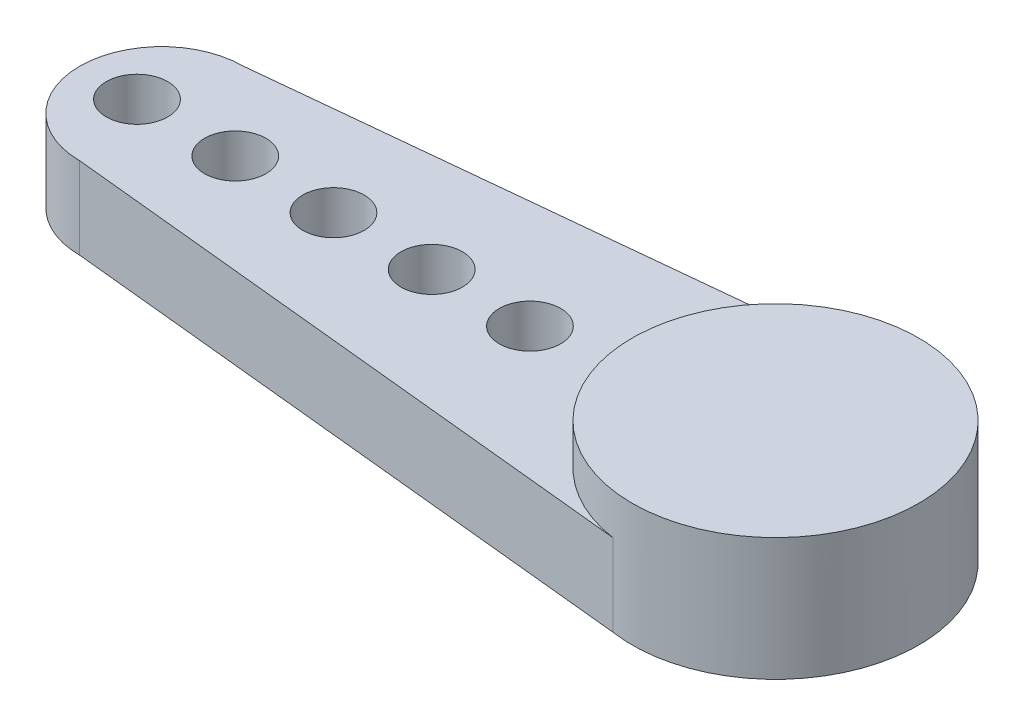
ISO-10303-21;
HEADER;
FILE_DESCRIPTION(('STEP AP214'),'2;1');
FILE_NAME('part.step','',(''),(''),'','','');
FILE_SCHEMA(('AUTOMOTIVE_DESIGN { 1 0 10303 214 1 1 1 1 }'));
ENDSEC;
DATA;
#1=APPLICATION_CONTEXT('core data for automotive mechanical design processes');
#2=APPLICATION_PROTOCOL_DEFINITION('international standard','automotive_design',2000,#1);
#3=PRODUCT_CONTEXT('',#1,'mechanical');
#4=PRODUCT('Part','Part','',(#3));
#5=PRODUCT_RELATED_PRODUCT_CATEGORY('part','',(#4));
#6=PRODUCT_DEFINITION_FORMATION('','',#4);
#7=PRODUCT_DEFINITION_CONTEXT('part definition',#1,'design');
#8=PRODUCT_DEFINITION('design','',#6,#7);
#9=PRODUCT_DEFINITION_SHAPE('','',#8);
#10=(LENGTH_UNIT() NAMED_UNIT(*) SI_UNIT(.MILLI.,.METRE.));
#11=(NAMED_UNIT(*) PLANE_ANGLE_UNIT() SI_UNIT($,.RADIAN.));
#12=(NAMED_UNIT(*) SI_UNIT($,.STERADIAN.) SOLID_ANGLE_UNIT());
#13=UNCERTAINTY_MEASURE_WITH_UNIT(LENGTH_MEASURE(1.E-05),#10,'distance_accuracy_value','');
#14=(GEOMETRIC_REPRESENTATION_CONTEXT(3) GLOBAL_UNCERTAINTY_ASSIGNED_CONTEXT((#13)) GLOBAL_UNIT_ASSIGNED_CONTEXT((#10,
#11,#12)) REPRESENTATION_CONTEXT('',''));
#15=CARTESIAN_POINT('',(0.,0.,0.));
#16=DIRECTION('',(0.,0.,1.));
#17=DIRECTION('',(1.,0.,0.));
#18=AXIS2_PLACEMENT_3D('',#15,#16,#17);
#19=CARTESIAN_POINT('',(0.,2.,0.));
#20=DIRECTION('',(0.,1.,0.));
#21=DIRECTION('',(0.,0.,1.));
#22=AXIS2_PLACEMENT_3D('',#19,#20,#21);
#23=PLANE('',#22);
#24=CARTESIAN_POINT('',(0.,2.,0.));
#25=DIRECTION('',(0.,1.,0.));
#26=DIRECTION('',(0.,0.,1.));
#27=AXIS2_PLACEMENT_3D('',#24,#25,#26);
#28=CIRCLE('',#27,3.5);
#29=CARTESIAN_POINT('',(-0.508869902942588,2.,-3.4628097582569));
#30=VERTEX_POINT('',#29);
#31=CARTESIAN_POINT('',(-0.508869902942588,2.,3.4628097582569));
#32=VERTEX_POINT('',#31);
#33=EDGE_CURVE('E87',#30,#32,#28,.T.);
#34=ORIENTED_EDGE('',*,*,#33,.F.);
#35=DIRECTION('',(-0.994943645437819,0.,0.100434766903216));
#36=VECTOR('',#35,1.);
#37=CARTESIAN_POINT('',(-15.,2.,-2.));
#38=LINE('',#37,#36);
#39=CARTESIAN_POINT('',(-15.,2.,-2.));
#40=VERTEX_POINT('',#39);
#41=EDGE_CURVE('E79',#30,#40,#38,.T.);
#42=ORIENTED_EDGE('',*,*,#41,.T.);
#43=CARTESIAN_POINT('',(-15.,2.,0.));
#44=DIRECTION('',(0.,1.,0.));
#45=DIRECTION('',(0.,0.,1.));
#46=AXIS2_PLACEMENT_3D('',#43,#44,#45);
#47=CIRCLE('',#46,2.);
#48=CARTESIAN_POINT('',(-15.,2.,2.));
#49=VERTEX_POINT('',#48);
#50=EDGE_CURVE('E93',#40,#49,#47,.T.);
#51=ORIENTED_EDGE('',*,*,#50,.T.);
#52=DIRECTION('',(0.994943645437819,0.,0.100434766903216));
#53=VECTOR('',#52,1.);
#54=CARTESIAN_POINT('',(-15.,2.,2.));
#55=LINE('',#54,#53);
#56=EDGE_CURVE('E52',#49,#32,#55,.T.);
#57=ORIENTED_EDGE('',*,*,#56,.T.);
#58=EDGE_LOOP('',(#34,#42,#51,#57));
#59=FACE_BOUND('',#58,.T.);
#60=CARTESIAN_POINT('',(-13.2,2.,0.));
#61=DIRECTION('',(0.,1.,0.));
#62=DIRECTION('',(0.,0.,1.));
#63=AXIS2_PLACEMENT_3D('',#60,#61,#62);
#64=CIRCLE('',#63,0.75);
#65=CARTESIAN_POINT('',(-13.2,2.,0.75));
#66=VERTEX_POINT('',#65);
#67=EDGE_CURVE('E108',#66,#66,#64,.T.);
#68=ORIENTED_EDGE('',*,*,#67,.F.);
#69=EDGE_LOOP('',(#68));
#70=FACE_BOUND('',#69,.T.);
#71=CARTESIAN_POINT('',(-8.4,2.,0.));
#72=DIRECTION('',(0.,1.,0.));
#73=DIRECTION('',(0.,0.,1.));
#74=AXIS2_PLACEMENT_3D('',#71,#72,#73);
#75=CIRCLE('',#74,0.75);
#76=CARTESIAN_POINT('',(-8.4,2.,0.75));
#77=VERTEX_POINT('',#76);
#78=EDGE_CURVE('E120',#77,#77,#75,.T.);
#79=ORIENTED_EDGE('',*,*,#78,.F.);
#80=EDGE_LOOP('',(#79));
#81=FACE_BOUND('',#80,.T.);
#82=CARTESIAN_POINT('',(-6.,2.,0.));
#83=DIRECTION('',(0.,1.,0.));
#84=DIRECTION('',(0.,0.,1.));
#85=AXIS2_PLACEMENT_3D('',#82,#83,#84);
#86=CIRCLE('',#85,0.75);
#87=CARTESIAN_POINT('',(-6.,2.,0.75));
#88=VERTEX_POINT('',#87);
#89=EDGE_CURVE('E126',#88,#88,#86,.T.);
#90=ORIENTED_EDGE('',*,*,#89,.F.);
#91=EDGE_LOOP('',(#90));
#92=FACE_BOUND('',#91,.T.);
#93=CARTESIAN_POINT('',(-10.8,2.,0.));
#94=DIRECTION('',(0.,1.,0.));
#95=DIRECTION('',(0.,0.,1.));
#96=AXIS2_PLACEMENT_3D('',#93,#94,#95);
#97=CIRCLE('',#96,0.75);
#98=CARTESIAN_POINT('',(-10.8,2.,0.75));
#99=VERTEX_POINT('',#98);
#100=EDGE_CURVE('E114',#99,#99,#97,.T.);
#101=ORIENTED_EDGE('',*,*,#100,.F.);
#102=EDGE_LOOP('',(#101));
#103=FACE_BOUND('',#102,.T.);
#104=CARTESIAN_POINT('',(-15.6,2.,0.));
#105=DIRECTION('',(0.,1.,0.));
#106=DIRECTION('',(0.,0.,1.));
#107=AXIS2_PLACEMENT_3D('',#104,#105,#106);
#108=CIRCLE('',#107,0.750000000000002);
#109=CARTESIAN_POINT('',(-15.6,2.,0.750000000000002));
#110=VERTEX_POINT('',#109);
#111=EDGE_CURVE('E102',#110,#110,#108,.T.);
#112=ORIENTED_EDGE('',*,*,#111,.F.);
#113=EDGE_LOOP('',(#112));
#114=FACE_BOUND('',#113,.T.);
#115=ADVANCED_FACE('F35',(#59,#70,#81,#92,#103,#114),#23,.T.);
#116=CARTESIAN_POINT('',(0.,0.,0.));
#117=DIRECTION('',(0.,1.,0.));
#118=DIRECTION('',(0.,0.,1.));
#119=AXIS2_PLACEMENT_3D('',#116,#117,#118);
#120=PLANE('',#119);
#121=CARTESIAN_POINT('',(0.,0.,0.));
#122=DIRECTION('',(0.,1.,0.));
#123=DIRECTION('',(0.,0.,1.));
#124=AXIS2_PLACEMENT_3D('',#121,#122,#123);
#125=CIRCLE('',#124,3.5);
#126=CARTESIAN_POINT('',(-0.508869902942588,0.,3.4628097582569));
#127=VERTEX_POINT('',#126);
#128=CARTESIAN_POINT('',(-0.508869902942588,0.,-3.4628097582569));
#129=VERTEX_POINT('',#128);
#130=EDGE_CURVE('E89',#127,#129,#125,.T.);
#131=ORIENTED_EDGE('',*,*,#130,.F.);
#132=DIRECTION('',(0.994943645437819,0.,0.100434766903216));
#133=VECTOR('',#132,1.);
#134=CARTESIAN_POINT('',(-15.,0.,2.));
#135=LINE('',#134,#133);
#136=CARTESIAN_POINT('',(-15.,0.,2.));
#137=VERTEX_POINT('',#136);
#138=EDGE_CURVE('E75',#137,#127,#135,.T.);
#139=ORIENTED_EDGE('',*,*,#138,.F.);
#140=CARTESIAN_POINT('',(-15.,0.,0.));
#141=DIRECTION('',(0.,1.,0.));
#142=DIRECTION('',(0.,0.,1.));
#143=AXIS2_PLACEMENT_3D('',#140,#141,#142);
#144=CIRCLE('',#143,2.);
#145=CARTESIAN_POINT('',(-15.,0.,-2.));
#146=VERTEX_POINT('',#145);
#147=EDGE_CURVE('E70',#146,#137,#144,.T.);
#148=ORIENTED_EDGE('',*,*,#147,.F.);
#149=DIRECTION('',(-0.994943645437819,0.,0.100434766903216));
#150=VECTOR('',#149,1.);
#151=CARTESIAN_POINT('',(-15.,0.,-2.));
#152=LINE('',#151,#150);
#153=EDGE_CURVE('E135',#129,#146,#152,.T.);
#154=ORIENTED_EDGE('',*,*,#153,.F.);
#155=EDGE_LOOP('',(#131,#139,#148,#154));
#156=FACE_BOUND('',#155,.T.);
#157=CARTESIAN_POINT('',(-6.,0.,0.));
#158=DIRECTION('',(0.,1.,0.));
#159=DIRECTION('',(0.,0.,1.));
#160=AXIS2_PLACEMENT_3D('',#157,#158,#159);
#161=CIRCLE('',#160,0.75);
#162=CARTESIAN_POINT('',(-6.,0.,0.75));
#163=VERTEX_POINT('',#162);
#164=EDGE_CURVE('E123',#163,#163,#161,.T.);
#165=ORIENTED_EDGE('',*,*,#164,.T.);
#166=EDGE_LOOP('',(#165));
#167=FACE_BOUND('',#166,.T.);
#168=CARTESIAN_POINT('',(-8.4,0.,0.));
#169=DIRECTION('',(0.,1.,0.));
#170=DIRECTION('',(0.,0.,1.));
#171=AXIS2_PLACEMENT_3D('',#168,#169,#170);
#172=CIRCLE('',#171,0.75);
#173=CARTESIAN_POINT('',(-8.4,0.,0.75));
#174=VERTEX_POINT('',#173);
#175=EDGE_CURVE('E117',#174,#174,#172,.T.);
#176=ORIENTED_EDGE('',*,*,#175,.T.);
#177=EDGE_LOOP('',(#176));
#178=FACE_BOUND('',#177,.T.);
#179=CARTESIAN_POINT('',(-10.8,0.,0.));
#180=DIRECTION('',(0.,1.,0.));
#181=DIRECTION('',(0.,0.,1.));
#182=AXIS2_PLACEMENT_3D('',#179,#180,#181);
#183=CIRCLE('',#182,0.75);
#184=CARTESIAN_POINT('',(-10.8,0.,0.75));
#185=VERTEX_POINT('',#184);
#186=EDGE_CURVE('E111',#185,#185,#183,.T.);
#187=ORIENTED_EDGE('',*,*,#186,.T.);
#188=EDGE_LOOP('',(#187));
#189=FACE_BOUND('',#188,.T.);
#190=CARTESIAN_POINT('',(-13.2,0.,0.));
#191=DIRECTION('',(0.,1.,0.));
#192=DIRECTION('',(0.,0.,1.));
#193=AXIS2_PLACEMENT_3D('',#190,#191,#192);
#194=CIRCLE('',#193,0.75);
#195=CARTESIAN_POINT('',(-13.2,0.,0.75));
#196=VERTEX_POINT('',#195);
#197=EDGE_CURVE('E105',#196,#196,#194,.T.);
#198=ORIENTED_EDGE('',*,*,#197,.T.);
#199=EDGE_LOOP('',(#198));
#200=FACE_BOUND('',#199,.T.);
#201=CARTESIAN_POINT('',(-15.6,0.,0.));
#202=DIRECTION('',(0.,1.,0.));
#203=DIRECTION('',(0.,0.,1.));
#204=AXIS2_PLACEMENT_3D('',#201,#202,#203);
#205=CIRCLE('',#204,0.750000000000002);
#206=CARTESIAN_POINT('',(-15.6,0.,0.750000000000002));
#207=VERTEX_POINT('',#206);
#208=EDGE_CURVE('E99',#207,#207,#205,.T.);
#209=ORIENTED_EDGE('',*,*,#208,.T.);
#210=EDGE_LOOP('',(#209));
#211=FACE_BOUND('',#210,.T.);
#212=ADVANCED_FACE('F143',(#156,#167,#178,#189,#200,#211),#120,.F.);
#213=CARTESIAN_POINT('',(0.,2.,0.));
#214=DIRECTION('',(0.,-1.,0.));
#215=DIRECTION('',(0.,0.,-1.));
#216=AXIS2_PLACEMENT_3D('',#213,#214,#215);
#217=CYLINDRICAL_SURFACE('',#216,3.5);
#218=ORIENTED_EDGE('',*,*,#130,.T.);
#219=DIRECTION('',(0.,-1.,0.));
#220=VECTOR('',#219,1.);
#221=CARTESIAN_POINT('',(-0.508869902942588,2.,-3.4628097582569));
#222=LINE('',#221,#220);
#223=EDGE_CURVE('E11',#30,#129,#222,.T.);
#224=ORIENTED_EDGE('',*,*,#223,.F.);
#225=ORIENTED_EDGE('',*,*,#33,.T.);
#226=DIRECTION('',(0.,-1.,0.));
#227=VECTOR('',#226,1.);
#228=CARTESIAN_POINT('',(-0.508869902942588,2.,3.4628097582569));
#229=LINE('',#228,#227);
#230=EDGE_CURVE('E133',#32,#127,#229,.T.);
#231=ORIENTED_EDGE('',*,*,#230,.T.);
#232=EDGE_LOOP('',(#218,#224,#225,#231));
#233=FACE_BOUND('',#232,.T.);
#234=CARTESIAN_POINT('',(0.,3.,0.));
#235=DIRECTION('',(0.,1.,0.));
#236=DIRECTION('',(0.,0.,1.));
#237=AXIS2_PLACEMENT_3D('',#234,#235,#236);
#238=CIRCLE('',#237,3.5);
#239=CARTESIAN_POINT('',(0.,3.,3.5));
#240=VERTEX_POINT('',#239);
#241=EDGE_CURVE('E96',#240,#240,#238,.T.);
#242=ORIENTED_EDGE('',*,*,#241,.F.);
#243=EDGE_LOOP('',(#242));
#244=FACE_BOUND('',#243,.T.);
#245=ADVANCED_FACE('F37',(#233,#244),#217,.T.);
#246=CARTESIAN_POINT('',(-15.,2.,-2.));
#247=DIRECTION('',(0.100434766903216,0.,0.994943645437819));
#248=DIRECTION('',(0.994943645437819,0.,-0.100434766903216));
#249=AXIS2_PLACEMENT_3D('',#246,#247,#248);
#250=PLANE('',#249);
#251=ORIENTED_EDGE('',*,*,#153,.T.);
#252=DIRECTION('',(0.,-1.,0.));
#253=VECTOR('',#252,1.);
#254=CARTESIAN_POINT('',(-15.,2.,-2.));
#255=LINE('',#254,#253);
#256=EDGE_CURVE('E44',#40,#146,#255,.T.);
#257=ORIENTED_EDGE('',*,*,#256,.F.);
#258=ORIENTED_EDGE('',*,*,#41,.F.);
#259=ORIENTED_EDGE('',*,*,#223,.T.);
#260=EDGE_LOOP('',(#251,#257,#258,#259));
#261=FACE_BOUND('',#260,.T.);
#262=ADVANCED_FACE('F91',(#261),#250,.F.);
#263=CARTESIAN_POINT('',(-15.,2.,0.));
#264=DIRECTION('',(0.,-1.,0.));
#265=DIRECTION('',(0.,0.,-1.));
#266=AXIS2_PLACEMENT_3D('',#263,#264,#265);
#267=CYLINDRICAL_SURFACE('',#266,2.);
#268=ORIENTED_EDGE('',*,*,#147,.T.);
#269=DIRECTION('',(0.,-1.,0.));
#270=VECTOR('',#269,1.);
#271=CARTESIAN_POINT('',(-15.,2.,2.));
#272=LINE('',#271,#270);
#273=EDGE_CURVE('E140',#49,#137,#272,.T.);
#274=ORIENTED_EDGE('',*,*,#273,.F.);
#275=ORIENTED_EDGE('',*,*,#50,.F.);
#276=ORIENTED_EDGE('',*,*,#256,.T.);
#277=EDGE_LOOP('',(#268,#274,#275,#276));
#278=FACE_BOUND('',#277,.T.);
#279=ADVANCED_FACE('F141',(#278),#267,.T.);
#280=CARTESIAN_POINT('',(-15.,2.,2.));
#281=DIRECTION('',(0.100434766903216,0.,-0.994943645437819));
#282=DIRECTION('',(-0.994943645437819,0.,-0.100434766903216));
#283=AXIS2_PLACEMENT_3D('',#280,#281,#282);
#284=PLANE('',#283);
#285=ORIENTED_EDGE('',*,*,#138,.T.);
#286=ORIENTED_EDGE('',*,*,#230,.F.);
#287=ORIENTED_EDGE('',*,*,#56,.F.);
#288=ORIENTED_EDGE('',*,*,#273,.T.);
#289=EDGE_LOOP('',(#285,#286,#287,#288));
#290=FACE_BOUND('',#289,.T.);
#291=ADVANCED_FACE('F180',(#290),#284,.F.);
#292=CARTESIAN_POINT('',(-6.,2.,0.));
#293=DIRECTION('',(0.,-1.,0.));
#294=DIRECTION('',(0.,0.,-1.));
#295=AXIS2_PLACEMENT_3D('',#292,#293,#294);
#296=CYLINDRICAL_SURFACE('',#295,0.75);
#297=ORIENTED_EDGE('',*,*,#89,.T.);
#298=EDGE_LOOP('',(#297));
#299=FACE_BOUND('',#298,.T.);
#300=ORIENTED_EDGE('',*,*,#164,.F.);
#301=EDGE_LOOP('',(#300));
#302=FACE_BOUND('',#301,.T.);
#303=ADVANCED_FACE('F177',(#299,#302),#296,.F.);
#304=CARTESIAN_POINT('',(-8.4,2.,0.));
#305=DIRECTION('',(0.,-1.,0.));
#306=DIRECTION('',(0.,0.,-1.));
#307=AXIS2_PLACEMENT_3D('',#304,#305,#306);
#308=CYLINDRICAL_SURFACE('',#307,0.75);
#309=ORIENTED_EDGE('',*,*,#78,.T.);
#310=EDGE_LOOP('',(#309));
#311=FACE_BOUND('',#310,.T.);
#312=ORIENTED_EDGE('',*,*,#175,.F.);
#313=EDGE_LOOP('',(#312));
#314=FACE_BOUND('',#313,.T.);
#315=ADVANCED_FACE('F217',(#311,#314),#308,.F.);
#316=CARTESIAN_POINT('',(-10.8,2.,0.));
#317=DIRECTION('',(0.,-1.,0.));
#318=DIRECTION('',(0.,0.,-1.));
#319=AXIS2_PLACEMENT_3D('',#316,#317,#318);
#320=CYLINDRICAL_SURFACE('',#319,0.75);
#321=ORIENTED_EDGE('',*,*,#100,.T.);
#322=EDGE_LOOP('',(#321));
#323=FACE_BOUND('',#322,.T.);
#324=ORIENTED_EDGE('',*,*,#186,.F.);
#325=EDGE_LOOP('',(#324));
#326=FACE_BOUND('',#325,.T.);
#327=ADVANCED_FACE('F169',(#323,#326),#320,.F.);
#328=CARTESIAN_POINT('',(-13.2,2.,0.));
#329=DIRECTION('',(0.,-1.,0.));
#330=DIRECTION('',(0.,0.,-1.));
#331=AXIS2_PLACEMENT_3D('',#328,#329,#330);
#332=CYLINDRICAL_SURFACE('',#331,0.75);
#333=ORIENTED_EDGE('',*,*,#67,.T.);
#334=EDGE_LOOP('',(#333));
#335=FACE_BOUND('',#334,.T.);
#336=ORIENTED_EDGE('',*,*,#197,.F.);
#337=EDGE_LOOP('',(#336));
#338=FACE_BOUND('',#337,.T.);
#339=ADVANCED_FACE('F160',(#335,#338),#332,.F.);
#340=CARTESIAN_POINT('',(-15.6,2.,0.));
#341=DIRECTION('',(0.,-1.,0.));
#342=DIRECTION('',(0.,0.,-1.));
#343=AXIS2_PLACEMENT_3D('',#340,#341,#342);
#344=CYLINDRICAL_SURFACE('',#343,0.750000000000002);
#345=ORIENTED_EDGE('',*,*,#111,.T.);
#346=EDGE_LOOP('',(#345));
#347=FACE_BOUND('',#346,.T.);
#348=ORIENTED_EDGE('',*,*,#208,.F.);
#349=EDGE_LOOP('',(#348));
#350=FACE_BOUND('',#349,.T.);
#351=ADVANCED_FACE('F157',(#347,#350),#344,.F.);
#352=CARTESIAN_POINT('',(0.,3.,0.));
#353=DIRECTION('',(0.,1.,0.));
#354=DIRECTION('',(0.,0.,1.));
#355=AXIS2_PLACEMENT_3D('',#352,#353,#354);
#356=PLANE('',#355);
#357=ORIENTED_EDGE('',*,*,#241,.T.);
#358=EDGE_LOOP('',(#357));
#359=FACE_BOUND('',#358,.T.);
#360=ADVANCED_FACE('F159',(#359),#356,.T.);
#361=CLOSED_SHELL('',(#115,#212,#245,#262,#279,#291,#303,#315,#327,#339,#351,#360));
#362=MANIFOLD_SOLID_BREP('B2',#361);
#363=ADVANCED_BREP_SHAPE_REPRESENTATION('',(#18,#362),#14);
#364=SHAPE_DEFINITION_REPRESENTATION(#9,#363);
ENDSEC;
END-ISO-10303-21;
